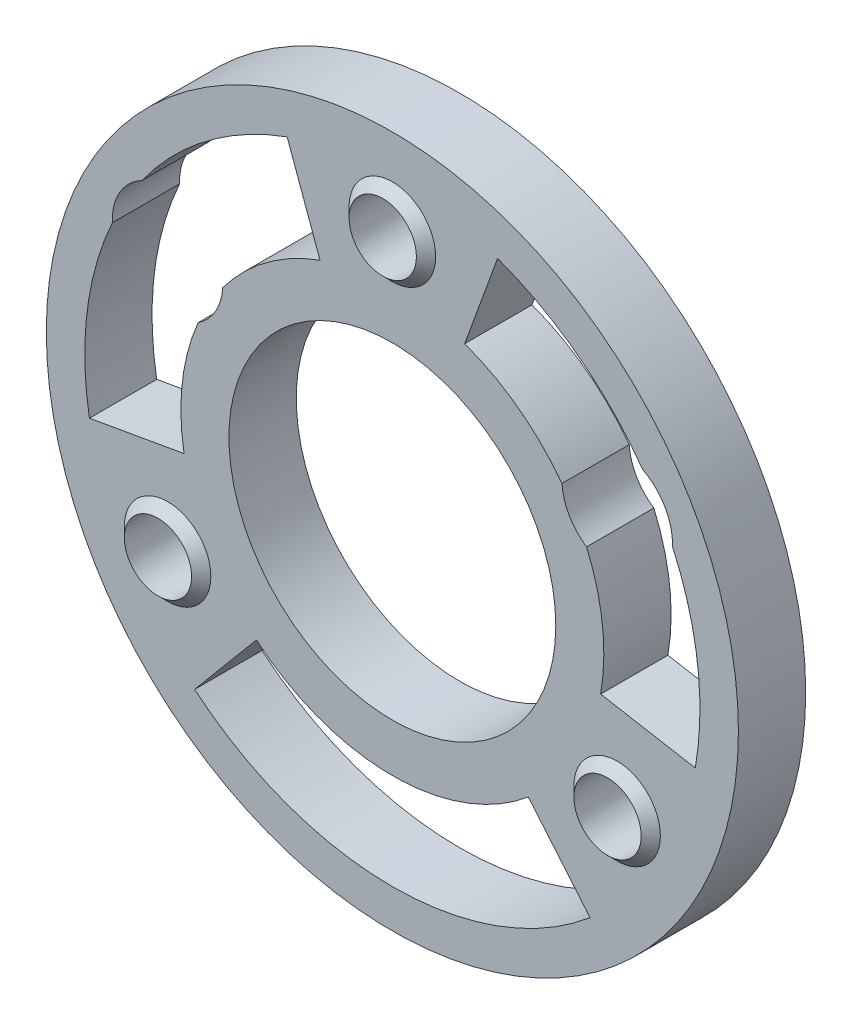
ISO-10303-21;
HEADER;
FILE_DESCRIPTION(('STEP AP214'),'2;1');
FILE_NAME('part.step','',(''),(''),'','','');
FILE_SCHEMA(('AUTOMOTIVE_DESIGN { 1 0 10303 214 1 1 1 1 }'));
ENDSEC;
DATA;
#1=APPLICATION_CONTEXT('core data for automotive mechanical design processes');
#2=APPLICATION_PROTOCOL_DEFINITION('international standard','automotive_design',2000,#1);
#3=PRODUCT_CONTEXT('',#1,'mechanical');
#4=PRODUCT('Part','Part','',(#3));
#5=PRODUCT_RELATED_PRODUCT_CATEGORY('part','',(#4));
#6=PRODUCT_DEFINITION_FORMATION('','',#4);
#7=PRODUCT_DEFINITION_CONTEXT('part definition',#1,'design');
#8=PRODUCT_DEFINITION('design','',#6,#7);
#9=PRODUCT_DEFINITION_SHAPE('','',#8);
#10=(LENGTH_UNIT() NAMED_UNIT(*) SI_UNIT(.MILLI.,.METRE.));
#11=(NAMED_UNIT(*) PLANE_ANGLE_UNIT() SI_UNIT($,.RADIAN.));
#12=(NAMED_UNIT(*) SI_UNIT($,.STERADIAN.) SOLID_ANGLE_UNIT());
#13=UNCERTAINTY_MEASURE_WITH_UNIT(LENGTH_MEASURE(1.E-05),#10,'distance_accuracy_value','');
#14=(GEOMETRIC_REPRESENTATION_CONTEXT(3) GLOBAL_UNCERTAINTY_ASSIGNED_CONTEXT((#13)) GLOBAL_UNIT_ASSIGNED_CONTEXT((#10,
#11,#12)) REPRESENTATION_CONTEXT('',''));
#15=CARTESIAN_POINT('',(0.,0.,0.));
#16=DIRECTION('',(0.,0.,1.));
#17=DIRECTION('',(1.,0.,0.));
#18=AXIS2_PLACEMENT_3D('',#15,#16,#17);
#19=CARTESIAN_POINT('',(0.,0.,3.5));
#20=DIRECTION('',(0.,0.,-1.));
#21=DIRECTION('',(-1.,0.,0.));
#22=AXIS2_PLACEMENT_3D('',#19,#20,#21);
#23=CYLINDRICAL_SURFACE('',#22,11.);
#24=DIRECTION('',(0.,0.,-1.));
#25=VECTOR('',#24,1.);
#26=CARTESIAN_POINT('',(-8.82194314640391,6.57064069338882,2.));
#27=LINE('',#26,#25);
#28=CARTESIAN_POINT('',(-8.82194314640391,6.57064069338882,3.5));
#29=VERTEX_POINT('',#28);
#30=CARTESIAN_POINT('',(-8.82194314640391,6.57064069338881,0.));
#31=VERTEX_POINT('',#30);
#32=EDGE_CURVE('E437',#29,#31,#27,.T.);
#33=ORIENTED_EDGE('',*,*,#32,.F.);
#34=CARTESIAN_POINT('',(0.,0.,3.5));
#35=DIRECTION('',(0.,0.,-1.));
#36=DIRECTION('',(-1.,0.,0.));
#37=AXIS2_PLACEMENT_3D('',#34,#35,#36);
#38=CIRCLE('',#37,11.);
#39=CARTESIAN_POINT('',(-3.76222157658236,10.336618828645,3.5));
#40=VERTEX_POINT('',#39);
#41=EDGE_CURVE('E249',#29,#40,#38,.T.);
#42=ORIENTED_EDGE('',*,*,#41,.T.);
#43=DIRECTION('',(0.,0.,-1.));
#44=VECTOR('',#43,1.);
#45=CARTESIAN_POINT('',(-3.76222157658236,10.336618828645,3.5));
#46=LINE('',#45,#44);
#47=CARTESIAN_POINT('',(-3.76222157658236,10.336618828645,0.));
#48=VERTEX_POINT('',#47);
#49=EDGE_CURVE('E288',#40,#48,#46,.T.);
#50=ORIENTED_EDGE('',*,*,#49,.T.);
#51=CARTESIAN_POINT('',(0.,0.,0.));
#52=DIRECTION('',(0.,0.,-1.));
#53=DIRECTION('',(-1.,0.,0.));
#54=AXIS2_PLACEMENT_3D('',#51,#52,#53);
#55=CIRCLE('',#54,11.);
#56=EDGE_CURVE('E243',#31,#48,#55,.T.);
#57=ORIENTED_EDGE('',*,*,#56,.F.);
#58=EDGE_LOOP('',(#33,#42,#50,#57));
#59=FACE_BOUND('',#58,.T.);
#60=ADVANCED_FACE('F47',(#59),#23,.T.);
#61=CARTESIAN_POINT('',(1.17961196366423E-13,0.,3.5));
#62=DIRECTION('',(0.,0.,-1.));
#63=DIRECTION('',(-1.,0.,0.));
#64=AXIS2_PLACEMENT_3D('',#61,#62,#63);
#65=CYLINDRICAL_SURFACE('',#64,16.0000000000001);
#66=DIRECTION('',(0.,0.,-1.));
#67=VECTOR('',#66,1.);
#68=CARTESIAN_POINT('',(-13.0198556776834,9.29964290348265,2.));
#69=LINE('',#68,#67);
#70=CARTESIAN_POINT('',(-13.0198556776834,9.29964290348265,0.));
#71=VERTEX_POINT('',#70);
#72=CARTESIAN_POINT('',(-13.0198556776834,9.29964290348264,3.5));
#73=VERTEX_POINT('',#72);
#74=EDGE_CURVE('E11',#71,#73,#69,.F.);
#75=ORIENTED_EDGE('',*,*,#74,.F.);
#76=CARTESIAN_POINT('',(1.17961196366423E-13,0.,0.));
#77=DIRECTION('',(0.,0.,1.));
#78=DIRECTION('',(-1.,0.,0.));
#79=AXIS2_PLACEMENT_3D('',#76,#77,#78);
#80=CIRCLE('',#79,16.0000000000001);
#81=CARTESIAN_POINT('',(-5.47232229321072,15.0350819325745,0.));
#82=VERTEX_POINT('',#81);
#83=EDGE_CURVE('E270',#82,#71,#80,.T.);
#84=ORIENTED_EDGE('',*,*,#83,.F.);
#85=DIRECTION('',(0.,0.,-1.));
#86=VECTOR('',#85,1.);
#87=CARTESIAN_POINT('',(-5.47232229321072,15.0350819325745,3.5));
#88=LINE('',#87,#86);
#89=CARTESIAN_POINT('',(-5.47232229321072,15.0350819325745,3.5));
#90=VERTEX_POINT('',#89);
#91=EDGE_CURVE('E285',#90,#82,#88,.T.);
#92=ORIENTED_EDGE('',*,*,#91,.F.);
#93=CARTESIAN_POINT('',(1.17961196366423E-13,0.,3.5));
#94=DIRECTION('',(0.,0.,1.));
#95=DIRECTION('',(-1.,0.,0.));
#96=AXIS2_PLACEMENT_3D('',#93,#94,#95);
#97=CIRCLE('',#96,16.0000000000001);
#98=EDGE_CURVE('E253',#90,#73,#97,.T.);
#99=ORIENTED_EDGE('',*,*,#98,.T.);
#100=EDGE_LOOP('',(#75,#84,#92,#99));
#101=FACE_BOUND('',#100,.T.);
#102=ADVANCED_FACE('F488',(#101),#65,.F.);
#103=CARTESIAN_POINT('',(0.,0.,3.5));
#104=DIRECTION('',(0.,0.,-1.));
#105=DIRECTION('',(-1.,0.,0.));
#106=AXIS2_PLACEMENT_3D('',#103,#104,#105);
#107=CYLINDRICAL_SURFACE('',#106,11.);
#108=DIRECTION('',(0.,0.,-1.));
#109=VECTOR('',#108,1.);
#110=CARTESIAN_POINT('',(10.1013133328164,4.3547065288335,2.));
#111=LINE('',#110,#109);
#112=CARTESIAN_POINT('',(10.1013133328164,4.3547065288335,3.5));
#113=VERTEX_POINT('',#112);
#114=CARTESIAN_POINT('',(10.1013133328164,4.3547065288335,0.));
#115=VERTEX_POINT('',#114);
#116=EDGE_CURVE('E446',#113,#115,#111,.T.);
#117=ORIENTED_EDGE('',*,*,#116,.F.);
#118=CARTESIAN_POINT('',(0.,0.,3.5));
#119=DIRECTION('',(0.,0.,-1.));
#120=DIRECTION('',(-1.,0.,0.));
#121=AXIS2_PLACEMENT_3D('',#118,#119,#120);
#122=CIRCLE('',#121,11.);
#123=CARTESIAN_POINT('',(10.8328852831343,-1.91012995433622,3.5));
#124=VERTEX_POINT('',#123);
#125=EDGE_CURVE('E228',#113,#124,#122,.T.);
#126=ORIENTED_EDGE('',*,*,#125,.T.);
#127=DIRECTION('',(0.,0.,-1.));
#128=VECTOR('',#127,1.);
#129=CARTESIAN_POINT('',(10.8328852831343,-1.91012995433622,3.5));
#130=LINE('',#129,#128);
#131=CARTESIAN_POINT('',(10.8328852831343,-1.91012995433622,0.));
#132=VERTEX_POINT('',#131);
#133=EDGE_CURVE('E239',#124,#132,#130,.T.);
#134=ORIENTED_EDGE('',*,*,#133,.T.);
#135=CARTESIAN_POINT('',(0.,0.,0.));
#136=DIRECTION('',(0.,0.,-1.));
#137=DIRECTION('',(-1.,0.,0.));
#138=AXIS2_PLACEMENT_3D('',#135,#136,#137);
#139=CIRCLE('',#138,11.);
#140=EDGE_CURVE('E362',#115,#132,#139,.T.);
#141=ORIENTED_EDGE('',*,*,#140,.F.);
#142=EDGE_LOOP('',(#117,#126,#134,#141));
#143=FACE_BOUND('',#142,.T.);
#144=ADVANCED_FACE('F461',(#143),#107,.T.);
#145=CARTESIAN_POINT('',(1.17961196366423E-13,0.,3.5));
#146=DIRECTION('',(0.,0.,-1.));
#147=DIRECTION('',(-1.,0.,0.));
#148=AXIS2_PLACEMENT_3D('',#145,#146,#147);
#149=CYLINDRICAL_SURFACE('',#148,15.9999999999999);
#150=DIRECTION('',(0.,0.,-1.));
#151=VECTOR('',#150,1.);
#152=CARTESIAN_POINT('',(14.5636548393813,6.62570431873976,2.));
#153=LINE('',#152,#151);
#154=CARTESIAN_POINT('',(14.5636548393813,6.62570431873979,0.));
#155=VERTEX_POINT('',#154);
#156=CARTESIAN_POINT('',(14.5636548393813,6.62570431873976,3.5));
#157=VERTEX_POINT('',#156);
#158=EDGE_CURVE('E195',#155,#157,#153,.F.);
#159=ORIENTED_EDGE('',*,*,#158,.F.);
#160=CARTESIAN_POINT('',(1.17961196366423E-13,0.,0.));
#161=DIRECTION('',(0.,0.,1.));
#162=DIRECTION('',(-1.,0.,0.));
#163=AXIS2_PLACEMENT_3D('',#160,#161,#162);
#164=CIRCLE('',#163,15.9999999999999);
#165=CARTESIAN_POINT('',(15.7569240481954,-2.77837084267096,0.));
#166=VERTEX_POINT('',#165);
#167=EDGE_CURVE('E208',#166,#155,#164,.T.);
#168=ORIENTED_EDGE('',*,*,#167,.F.);
#169=DIRECTION('',(0.,0.,-1.));
#170=VECTOR('',#169,1.);
#171=CARTESIAN_POINT('',(15.7569240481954,-2.77837084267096,3.5));
#172=LINE('',#171,#170);
#173=CARTESIAN_POINT('',(15.7569240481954,-2.77837084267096,3.5));
#174=VERTEX_POINT('',#173);
#175=EDGE_CURVE('E236',#174,#166,#172,.T.);
#176=ORIENTED_EDGE('',*,*,#175,.F.);
#177=CARTESIAN_POINT('',(1.17961196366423E-13,0.,3.5));
#178=DIRECTION('',(0.,0.,1.));
#179=DIRECTION('',(-1.,0.,0.));
#180=AXIS2_PLACEMENT_3D('',#177,#178,#179);
#181=CIRCLE('',#180,15.9999999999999);
#182=EDGE_CURVE('E340',#174,#157,#181,.T.);
#183=ORIENTED_EDGE('',*,*,#182,.T.);
#184=EDGE_LOOP('',(#159,#168,#176,#183));
#185=FACE_BOUND('',#184,.T.);
#186=ADVANCED_FACE('F470',(#185),#149,.F.);
#187=CARTESIAN_POINT('',(0.,0.,3.5));
#188=DIRECTION('',(0.,0.,1.));
#189=DIRECTION('',(1.,0.,0.));
#190=AXIS2_PLACEMENT_3D('',#187,#188,#189);
#191=PLANE('',#190);
#192=CARTESIAN_POINT('',(11.6913429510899,6.75000000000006,3.5));
#193=DIRECTION('',(0.,0.,1.));
#194=DIRECTION('',(1.,0.,0.));
#195=AXIS2_PLACEMENT_3D('',#192,#193,#194);
#196=CIRCLE('',#195,2.875);
#197=CARTESIAN_POINT('',(8.82194314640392,6.57064069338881,3.5));
#198=VERTEX_POINT('',#197);
#199=EDGE_CURVE('E449',#198,#113,#196,.T.);
#200=ORIENTED_EDGE('',*,*,#199,.F.);
#201=CARTESIAN_POINT('',(3.76222157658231,10.336618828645,3.5));
#202=VERTEX_POINT('',#201);
#203=EDGE_CURVE('E349',#202,#198,#122,.T.);
#204=ORIENTED_EDGE('',*,*,#203,.F.);
#205=DIRECTION('',(-0.342020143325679,-0.939692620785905,0.));
#206=VECTOR('',#205,1.);
#207=CARTESIAN_POINT('',(5.4723222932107,15.0350819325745,3.5));
#208=LINE('',#207,#206);
#209=CARTESIAN_POINT('',(5.4723222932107,15.0350819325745,3.5));
#210=VERTEX_POINT('',#209);
#211=EDGE_CURVE('E233',#210,#202,#208,.T.);
#212=ORIENTED_EDGE('',*,*,#211,.F.);
#213=CARTESIAN_POINT('',(13.0198556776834,9.29964290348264,3.5));
#214=VERTEX_POINT('',#213);
#215=EDGE_CURVE('E344',#214,#210,#181,.T.);
#216=ORIENTED_EDGE('',*,*,#215,.F.);
#217=EDGE_CURVE('E190',#157,#214,#196,.T.);
#218=ORIENTED_EDGE('',*,*,#217,.F.);
#219=ORIENTED_EDGE('',*,*,#182,.F.);
#220=DIRECTION('',(0.984807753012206,-0.173648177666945,0.));
#221=VECTOR('',#220,1.);
#222=CARTESIAN_POINT('',(15.7569240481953,-2.77837084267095,3.5));
#223=LINE('',#222,#221);
#224=EDGE_CURVE('E347',#124,#174,#223,.T.);
#225=ORIENTED_EDGE('',*,*,#224,.F.);
#226=ORIENTED_EDGE('',*,*,#125,.F.);
#227=EDGE_LOOP('',(#200,#204,#212,#216,#218,#219,#225,#226));
#228=FACE_BOUND('',#227,.T.);
#229=CARTESIAN_POINT('',(-11.6913429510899,6.75000000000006,3.5));
#230=DIRECTION('',(0.,0.,1.));
#231=DIRECTION('',(1.,0.,0.));
#232=AXIS2_PLACEMENT_3D('',#229,#230,#231);
#233=CIRCLE('',#232,2.875);
#234=CARTESIAN_POINT('',(-14.5636548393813,6.62570431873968,3.5));
#235=VERTEX_POINT('',#234);
#236=EDGE_CURVE('E71',#73,#235,#233,.T.);
#237=ORIENTED_EDGE('',*,*,#236,.F.);
#238=ORIENTED_EDGE('',*,*,#98,.F.);
#239=DIRECTION('',(-0.342020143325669,0.939692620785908,0.));
#240=VECTOR('',#239,1.);
#241=CARTESIAN_POINT('',(-5.47232229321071,15.0350819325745,3.5));
#242=LINE('',#241,#240);
#243=EDGE_CURVE('E248',#40,#90,#242,.T.);
#244=ORIENTED_EDGE('',*,*,#243,.F.);
#245=ORIENTED_EDGE('',*,*,#41,.F.);
#246=CARTESIAN_POINT('',(-10.1013133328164,4.35470652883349,3.5));
#247=VERTEX_POINT('',#246);
#248=EDGE_CURVE('E440',#247,#29,#233,.T.);
#249=ORIENTED_EDGE('',*,*,#248,.F.);
#250=CARTESIAN_POINT('',(-10.8328852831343,-1.91012995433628,3.5));
#251=VERTEX_POINT('',#250);
#252=EDGE_CURVE('E244',#251,#247,#38,.T.);
#253=ORIENTED_EDGE('',*,*,#252,.F.);
#254=DIRECTION('',(0.984807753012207,0.173648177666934,0.));
#255=VECTOR('',#254,1.);
#256=CARTESIAN_POINT('',(-15.7569240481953,-2.77837084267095,3.5));
#257=LINE('',#256,#255);
#258=CARTESIAN_POINT('',(-15.7569240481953,-2.77837084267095,3.5));
#259=VERTEX_POINT('',#258);
#260=EDGE_CURVE('E257',#259,#251,#257,.T.);
#261=ORIENTED_EDGE('',*,*,#260,.F.);
#262=EDGE_CURVE('E252',#235,#259,#97,.T.);
#263=ORIENTED_EDGE('',*,*,#262,.F.);
#264=EDGE_LOOP('',(#237,#238,#244,#245,#249,#253,#261,#263));
#265=FACE_BOUND('',#264,.T.);
#266=CARTESIAN_POINT('',(-11.6913429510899,-6.75000000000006,3.5));
#267=DIRECTION('',(0.,0.,1.));
#268=DIRECTION('',(1.,0.,0.));
#269=AXIS2_PLACEMENT_3D('',#266,#267,#268);
#270=CIRCLE('',#269,2.25);
#271=CARTESIAN_POINT('',(-9.44134295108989,-6.75000000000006,3.5));
#272=VERTEX_POINT('',#271);
#273=EDGE_CURVE('E425',#272,#272,#270,.T.);
#274=ORIENTED_EDGE('',*,*,#273,.F.);
#275=EDGE_LOOP('',(#274));
#276=FACE_BOUND('',#275,.T.);
#277=DIRECTION('',(-0.642787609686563,-0.766044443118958,0.));
#278=VECTOR('',#277,1.);
#279=CARTESIAN_POINT('',(-10.2846017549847,-12.2567110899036,3.5));
#280=LINE('',#279,#278);
#281=CARTESIAN_POINT('',(-7.07066370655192,-8.42648887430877,3.5));
#282=VERTEX_POINT('',#281);
#283=CARTESIAN_POINT('',(-10.2846017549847,-12.2567110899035,3.5));
#284=VERTEX_POINT('',#283);
#285=EDGE_CURVE('E409',#282,#284,#280,.T.);
#286=ORIENTED_EDGE('',*,*,#285,.F.);
#287=CARTESIAN_POINT('',(0.,0.,3.5));
#288=DIRECTION('',(0.,0.,-1.));
#289=DIRECTION('',(-1.,0.,0.));
#290=AXIS2_PLACEMENT_3D('',#287,#288,#289);
#291=CIRCLE('',#290,11.);
#292=CARTESIAN_POINT('',(7.07066370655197,-8.42648887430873,3.5));
#293=VERTEX_POINT('',#292);
#294=EDGE_CURVE('E390',#293,#282,#291,.T.);
#295=ORIENTED_EDGE('',*,*,#294,.F.);
#296=DIRECTION('',(-0.642787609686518,0.766044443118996,0.));
#297=VECTOR('',#296,1.);
#298=CARTESIAN_POINT('',(10.2846017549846,-12.2567110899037,3.5));
#299=LINE('',#298,#297);
#300=CARTESIAN_POINT('',(10.2846017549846,-12.2567110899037,3.5));
#301=VERTEX_POINT('',#300);
#302=EDGE_CURVE('E385',#301,#293,#299,.T.);
#303=ORIENTED_EDGE('',*,*,#302,.F.);
#304=CARTESIAN_POINT('',(1.17961196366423E-13,0.,3.5));
#305=DIRECTION('',(0.,0.,1.));
#306=DIRECTION('',(-1.,0.,0.));
#307=AXIS2_PLACEMENT_3D('',#304,#305,#306);
#308=CIRCLE('',#307,16.);
#309=EDGE_CURVE('E405',#284,#301,#308,.T.);
#310=ORIENTED_EDGE('',*,*,#309,.F.);
#311=EDGE_LOOP('',(#286,#295,#303,#310));
#312=FACE_BOUND('',#311,.T.);
#313=CARTESIAN_POINT('',(0.,0.,3.5));
#314=DIRECTION('',(0.,0.,1.));
#315=DIRECTION('',(1.,0.,0.));
#316=AXIS2_PLACEMENT_3D('',#313,#314,#315);
#317=CIRCLE('',#316,18.);
#318=CARTESIAN_POINT('',(18.,0.,3.5));
#319=VERTEX_POINT('',#318);
#320=EDGE_CURVE('E196',#319,#319,#317,.T.);
#321=ORIENTED_EDGE('',*,*,#320,.T.);
#322=EDGE_LOOP('',(#321));
#323=FACE_BOUND('',#322,.T.);
#324=CARTESIAN_POINT('',(0.,0.,3.5));
#325=DIRECTION('',(0.,0.,1.));
#326=DIRECTION('',(1.,0.,0.));
#327=AXIS2_PLACEMENT_3D('',#324,#325,#326);
#328=CIRCLE('',#327,8.5);
#329=CARTESIAN_POINT('',(8.5,0.,3.5));
#330=VERTEX_POINT('',#329);
#331=EDGE_CURVE('E305',#330,#330,#328,.T.);
#332=ORIENTED_EDGE('',*,*,#331,.F.);
#333=EDGE_LOOP('',(#332));
#334=FACE_BOUND('',#333,.T.);
#335=CARTESIAN_POINT('',(0.,13.5,3.5));
#336=DIRECTION('',(0.,0.,1.));
#337=DIRECTION('',(1.,0.,0.));
#338=AXIS2_PLACEMENT_3D('',#335,#336,#337);
#339=CIRCLE('',#338,2.25);
#340=CARTESIAN_POINT('',(2.25,13.5,3.5));
#341=VERTEX_POINT('',#340);
#342=EDGE_CURVE('E402',#341,#341,#339,.T.);
#343=ORIENTED_EDGE('',*,*,#342,.F.);
#344=EDGE_LOOP('',(#343));
#345=FACE_BOUND('',#344,.T.);
#346=CARTESIAN_POINT('',(11.6913429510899,-6.75000000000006,3.5));
#347=DIRECTION('',(0.,0.,1.));
#348=DIRECTION('',(1.,0.,0.));
#349=AXIS2_PLACEMENT_3D('',#346,#347,#348);
#350=CIRCLE('',#349,2.25);
#351=CARTESIAN_POINT('',(13.9413429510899,-6.75000000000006,3.5));
#352=VERTEX_POINT('',#351);
#353=EDGE_CURVE('E433',#352,#352,#350,.T.);
#354=ORIENTED_EDGE('',*,*,#353,.F.);
#355=EDGE_LOOP('',(#354));
#356=FACE_BOUND('',#355,.T.);
#357=ADVANCED_FACE('F463',(#228,#265,#276,#312,#323,#334,#345,#356),#191,.T.);
#358=CARTESIAN_POINT('',(0.,0.,0.));
#359=DIRECTION('',(0.,0.,1.));
#360=DIRECTION('',(1.,0.,0.));
#361=AXIS2_PLACEMENT_3D('',#358,#359,#360);
#362=PLANE('',#361);
#363=CARTESIAN_POINT('',(3.76222157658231,10.336618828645,0.));
#364=VERTEX_POINT('',#363);
#365=CARTESIAN_POINT('',(8.82194314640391,6.57064069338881,0.));
#366=VERTEX_POINT('',#365);
#367=EDGE_CURVE('E222',#364,#366,#139,.T.);
#368=ORIENTED_EDGE('',*,*,#367,.T.);
#369=CARTESIAN_POINT('',(11.6913429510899,6.75000000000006,0.));
#370=DIRECTION('',(0.,0.,-1.));
#371=DIRECTION('',(-1.,0.,0.));
#372=AXIS2_PLACEMENT_3D('',#369,#370,#371);
#373=CIRCLE('',#372,2.875);
#374=EDGE_CURVE('E210',#115,#366,#373,.T.);
#375=ORIENTED_EDGE('',*,*,#374,.F.);
#376=ORIENTED_EDGE('',*,*,#140,.T.);
#377=DIRECTION('',(0.984807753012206,-0.173648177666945,0.));
#378=VECTOR('',#377,1.);
#379=CARTESIAN_POINT('',(15.7569240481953,-2.77837084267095,0.));
#380=LINE('',#379,#378);
#381=EDGE_CURVE('E217',#132,#166,#380,.T.);
#382=ORIENTED_EDGE('',*,*,#381,.T.);
#383=ORIENTED_EDGE('',*,*,#167,.T.);
#384=CARTESIAN_POINT('',(13.0198556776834,9.29964290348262,0.));
#385=VERTEX_POINT('',#384);
#386=EDGE_CURVE('E187',#385,#155,#373,.T.);
#387=ORIENTED_EDGE('',*,*,#386,.F.);
#388=CARTESIAN_POINT('',(5.4723222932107,15.0350819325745,0.));
#389=VERTEX_POINT('',#388);
#390=EDGE_CURVE('E204',#385,#389,#164,.T.);
#391=ORIENTED_EDGE('',*,*,#390,.T.);
#392=DIRECTION('',(-0.342020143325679,-0.939692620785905,0.));
#393=VECTOR('',#392,1.);
#394=CARTESIAN_POINT('',(5.4723222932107,15.0350819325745,0.));
#395=LINE('',#394,#393);
#396=EDGE_CURVE('E221',#389,#364,#395,.T.);
#397=ORIENTED_EDGE('',*,*,#396,.T.);
#398=EDGE_LOOP('',(#368,#375,#376,#382,#383,#387,#391,#397));
#399=FACE_BOUND('',#398,.T.);
#400=CARTESIAN_POINT('',(11.6913429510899,-6.75000000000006,0.));
#401=DIRECTION('',(0.,0.,1.));
#402=DIRECTION('',(1.,0.,0.));
#403=AXIS2_PLACEMENT_3D('',#400,#401,#402);
#404=CIRCLE('',#403,1.75);
#405=CARTESIAN_POINT('',(13.4413429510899,-6.75000000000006,0.));
#406=VERTEX_POINT('',#405);
#407=EDGE_CURVE('E292',#406,#406,#404,.T.);
#408=ORIENTED_EDGE('',*,*,#407,.T.);
#409=EDGE_LOOP('',(#408));
#410=FACE_BOUND('',#409,.T.);
#411=CARTESIAN_POINT('',(-11.6913429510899,-6.75000000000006,0.));
#412=DIRECTION('',(0.,0.,1.));
#413=DIRECTION('',(1.,0.,0.));
#414=AXIS2_PLACEMENT_3D('',#411,#412,#413);
#415=CIRCLE('',#414,1.75);
#416=CARTESIAN_POINT('',(-9.94134295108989,-6.75000000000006,0.));
#417=VERTEX_POINT('',#416);
#418=EDGE_CURVE('E296',#417,#417,#415,.T.);
#419=ORIENTED_EDGE('',*,*,#418,.T.);
#420=EDGE_LOOP('',(#419));
#421=FACE_BOUND('',#420,.T.);
#422=CARTESIAN_POINT('',(0.,13.5,0.));
#423=DIRECTION('',(0.,0.,1.));
#424=DIRECTION('',(1.,0.,0.));
#425=AXIS2_PLACEMENT_3D('',#422,#423,#424);
#426=CIRCLE('',#425,1.75);
#427=CARTESIAN_POINT('',(1.75,13.5,0.));
#428=VERTEX_POINT('',#427);
#429=EDGE_CURVE('E300',#428,#428,#426,.T.);
#430=ORIENTED_EDGE('',*,*,#429,.T.);
#431=EDGE_LOOP('',(#430));
#432=FACE_BOUND('',#431,.T.);
#433=CARTESIAN_POINT('',(0.,0.,0.));
#434=DIRECTION('',(0.,0.,1.));
#435=DIRECTION('',(1.,0.,0.));
#436=AXIS2_PLACEMENT_3D('',#433,#434,#435);
#437=CIRCLE('',#436,8.5);
#438=CARTESIAN_POINT('',(8.5,0.,0.));
#439=VERTEX_POINT('',#438);
#440=EDGE_CURVE('E304',#439,#439,#437,.T.);
#441=ORIENTED_EDGE('',*,*,#440,.T.);
#442=EDGE_LOOP('',(#441));
#443=FACE_BOUND('',#442,.T.);
#444=CARTESIAN_POINT('',(0.,0.,0.));
#445=DIRECTION('',(0.,0.,1.));
#446=DIRECTION('',(1.,0.,0.));
#447=AXIS2_PLACEMENT_3D('',#444,#445,#446);
#448=CIRCLE('',#447,18.);
#449=CARTESIAN_POINT('',(18.,0.,0.));
#450=VERTEX_POINT('',#449);
#451=EDGE_CURVE('E309',#450,#450,#448,.T.);
#452=ORIENTED_EDGE('',*,*,#451,.F.);
#453=EDGE_LOOP('',(#452));
#454=FACE_BOUND('',#453,.T.);
#455=ORIENTED_EDGE('',*,*,#83,.T.);
#456=CARTESIAN_POINT('',(-11.6913429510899,6.75000000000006,0.));
#457=DIRECTION('',(0.,0.,-1.));
#458=DIRECTION('',(-1.,0.,0.));
#459=AXIS2_PLACEMENT_3D('',#456,#457,#458);
#460=CIRCLE('',#459,2.875);
#461=CARTESIAN_POINT('',(-14.5636548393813,6.62570431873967,0.));
#462=VERTEX_POINT('',#461);
#463=EDGE_CURVE('E323',#462,#71,#460,.T.);
#464=ORIENTED_EDGE('',*,*,#463,.F.);
#465=CARTESIAN_POINT('',(-15.7569240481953,-2.77837084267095,0.));
#466=VERTEX_POINT('',#465);
#467=EDGE_CURVE('E269',#462,#466,#80,.T.);
#468=ORIENTED_EDGE('',*,*,#467,.T.);
#469=DIRECTION('',(0.984807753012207,0.173648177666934,0.));
#470=VECTOR('',#469,1.);
#471=CARTESIAN_POINT('',(-15.7569240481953,-2.77837084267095,0.));
#472=LINE('',#471,#470);
#473=CARTESIAN_POINT('',(-10.8328852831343,-1.91012995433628,0.));
#474=VERTEX_POINT('',#473);
#475=EDGE_CURVE('E274',#466,#474,#472,.T.);
#476=ORIENTED_EDGE('',*,*,#475,.T.);
#477=CARTESIAN_POINT('',(-10.1013133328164,4.3547065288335,0.));
#478=VERTEX_POINT('',#477);
#479=EDGE_CURVE('E261',#474,#478,#55,.T.);
#480=ORIENTED_EDGE('',*,*,#479,.T.);
#481=EDGE_CURVE('E64',#31,#478,#460,.T.);
#482=ORIENTED_EDGE('',*,*,#481,.F.);
#483=ORIENTED_EDGE('',*,*,#56,.T.);
#484=DIRECTION('',(-0.342020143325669,0.939692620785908,0.));
#485=VECTOR('',#484,1.);
#486=CARTESIAN_POINT('',(-5.47232229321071,15.0350819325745,0.));
#487=LINE('',#486,#485);
#488=EDGE_CURVE('E265',#48,#82,#487,.T.);
#489=ORIENTED_EDGE('',*,*,#488,.T.);
#490=EDGE_LOOP('',(#455,#464,#468,#476,#480,#482,#483,#489));
#491=FACE_BOUND('',#490,.T.);
#492=CARTESIAN_POINT('',(0.,0.,0.));
#493=DIRECTION('',(0.,0.,-1.));
#494=DIRECTION('',(-1.,0.,0.));
#495=AXIS2_PLACEMENT_3D('',#492,#493,#494);
#496=CIRCLE('',#495,11.);
#497=CARTESIAN_POINT('',(7.07066370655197,-8.42648887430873,0.));
#498=VERTEX_POINT('',#497);
#499=CARTESIAN_POINT('',(-7.07066370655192,-8.42648887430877,0.));
#500=VERTEX_POINT('',#499);
#501=EDGE_CURVE('E399',#498,#500,#496,.T.);
#502=ORIENTED_EDGE('',*,*,#501,.T.);
#503=DIRECTION('',(-0.642787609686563,-0.766044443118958,0.));
#504=VECTOR('',#503,1.);
#505=CARTESIAN_POINT('',(-10.2846017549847,-12.2567110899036,0.));
#506=LINE('',#505,#504);
#507=CARTESIAN_POINT('',(-10.2846017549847,-12.2567110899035,0.));
#508=VERTEX_POINT('',#507);
#509=EDGE_CURVE('E395',#500,#508,#506,.T.);
#510=ORIENTED_EDGE('',*,*,#509,.T.);
#511=CARTESIAN_POINT('',(1.17961196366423E-13,0.,0.));
#512=DIRECTION('',(0.,0.,1.));
#513=DIRECTION('',(-1.,0.,0.));
#514=AXIS2_PLACEMENT_3D('',#511,#512,#513);
#515=CIRCLE('',#514,16.);
#516=CARTESIAN_POINT('',(10.2846017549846,-12.2567110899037,0.));
#517=VERTEX_POINT('',#516);
#518=EDGE_CURVE('E391',#508,#517,#515,.T.);
#519=ORIENTED_EDGE('',*,*,#518,.T.);
#520=DIRECTION('',(-0.642787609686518,0.766044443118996,0.));
#521=VECTOR('',#520,1.);
#522=CARTESIAN_POINT('',(10.2846017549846,-12.2567110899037,0.));
#523=LINE('',#522,#521);
#524=EDGE_CURVE('E386',#517,#498,#523,.T.);
#525=ORIENTED_EDGE('',*,*,#524,.T.);
#526=EDGE_LOOP('',(#502,#510,#519,#525));
#527=FACE_BOUND('',#526,.T.);
#528=ADVANCED_FACE('F201',(#399,#410,#421,#432,#443,#454,#491,#527),#362,.F.);
#529=CARTESIAN_POINT('',(0.,0.,3.5));
#530=DIRECTION('',(0.,0.,-1.));
#531=DIRECTION('',(-1.,0.,0.));
#532=AXIS2_PLACEMENT_3D('',#529,#530,#531);
#533=CYLINDRICAL_SURFACE('',#532,18.);
#534=ORIENTED_EDGE('',*,*,#320,.F.);
#535=EDGE_LOOP('',(#534));
#536=FACE_BOUND('',#535,.T.);
#537=ORIENTED_EDGE('',*,*,#451,.T.);
#538=EDGE_LOOP('',(#537));
#539=FACE_BOUND('',#538,.T.);
#540=ADVANCED_FACE('F567',(#536,#539),#533,.T.);
#541=CARTESIAN_POINT('',(0.,0.,3.5));
#542=DIRECTION('',(0.,0.,-1.));
#543=DIRECTION('',(-1.,0.,0.));
#544=AXIS2_PLACEMENT_3D('',#541,#542,#543);
#545=CYLINDRICAL_SURFACE('',#544,8.5);
#546=ORIENTED_EDGE('',*,*,#331,.T.);
#547=EDGE_LOOP('',(#546));
#548=FACE_BOUND('',#547,.T.);
#549=ORIENTED_EDGE('',*,*,#440,.F.);
#550=EDGE_LOOP('',(#549));
#551=FACE_BOUND('',#550,.T.);
#552=ADVANCED_FACE('F570',(#548,#551),#545,.F.);
#553=CARTESIAN_POINT('',(0.,13.5,3.5));
#554=DIRECTION('',(0.,0.,-1.));
#555=DIRECTION('',(-1.,0.,0.));
#556=AXIS2_PLACEMENT_3D('',#553,#554,#555);
#557=CYLINDRICAL_SURFACE('',#556,1.75);
#558=ORIENTED_EDGE('',*,*,#429,.F.);
#559=EDGE_LOOP('',(#558));
#560=FACE_BOUND('',#559,.T.);
#561=CARTESIAN_POINT('',(0.,13.5,4.));
#562=DIRECTION('',(0.,0.,1.));
#563=DIRECTION('',(1.,0.,0.));
#564=AXIS2_PLACEMENT_3D('',#561,#562,#563);
#565=CIRCLE('',#564,1.75);
#566=CARTESIAN_POINT('',(1.75,13.5,4.));
#567=VERTEX_POINT('',#566);
#568=EDGE_CURVE('E417',#567,#567,#565,.T.);
#569=ORIENTED_EDGE('',*,*,#568,.T.);
#570=EDGE_LOOP('',(#569));
#571=FACE_BOUND('',#570,.T.);
#572=ADVANCED_FACE('F592',(#560,#571),#557,.F.);
#573=CARTESIAN_POINT('',(-11.6913429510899,-6.75000000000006,3.5));
#574=DIRECTION('',(0.,0.,-1.));
#575=DIRECTION('',(-1.,0.,0.));
#576=AXIS2_PLACEMENT_3D('',#573,#574,#575);
#577=CYLINDRICAL_SURFACE('',#576,1.75);
#578=ORIENTED_EDGE('',*,*,#418,.F.);
#579=EDGE_LOOP('',(#578));
#580=FACE_BOUND('',#579,.T.);
#581=CARTESIAN_POINT('',(-11.6913429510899,-6.75000000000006,4.));
#582=DIRECTION('',(0.,0.,1.));
#583=DIRECTION('',(1.,0.,0.));
#584=AXIS2_PLACEMENT_3D('',#581,#582,#583);
#585=CIRCLE('',#584,1.75);
#586=CARTESIAN_POINT('',(-9.94134295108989,-6.75000000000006,4.));
#587=VERTEX_POINT('',#586);
#588=EDGE_CURVE('E421',#587,#587,#585,.T.);
#589=ORIENTED_EDGE('',*,*,#588,.T.);
#590=EDGE_LOOP('',(#589));
#591=FACE_BOUND('',#590,.T.);
#592=ADVANCED_FACE('F510',(#580,#591),#577,.F.);
#593=CARTESIAN_POINT('',(11.6913429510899,-6.75000000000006,3.5));
#594=DIRECTION('',(0.,0.,-1.));
#595=DIRECTION('',(-1.,0.,0.));
#596=AXIS2_PLACEMENT_3D('',#593,#594,#595);
#597=CYLINDRICAL_SURFACE('',#596,1.75);
#598=ORIENTED_EDGE('',*,*,#407,.F.);
#599=EDGE_LOOP('',(#598));
#600=FACE_BOUND('',#599,.T.);
#601=CARTESIAN_POINT('',(11.6913429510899,-6.75000000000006,4.));
#602=DIRECTION('',(0.,0.,1.));
#603=DIRECTION('',(1.,0.,0.));
#604=AXIS2_PLACEMENT_3D('',#601,#602,#603);
#605=CIRCLE('',#604,1.75);
#606=CARTESIAN_POINT('',(13.4413429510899,-6.75000000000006,4.));
#607=VERTEX_POINT('',#606);
#608=EDGE_CURVE('E429',#607,#607,#605,.T.);
#609=ORIENTED_EDGE('',*,*,#608,.T.);
#610=EDGE_LOOP('',(#609));
#611=FACE_BOUND('',#610,.T.);
#612=ADVANCED_FACE('F503',(#600,#611),#597,.F.);
#613=DIRECTION('',(0.,0.,-1.));
#614=VECTOR('',#613,1.);
#615=CARTESIAN_POINT('',(-10.1013133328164,4.3547065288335,2.));
#616=LINE('',#615,#614);
#617=EDGE_CURVE('E441',#478,#247,#616,.F.);
#618=ORIENTED_EDGE('',*,*,#617,.F.);
#619=ORIENTED_EDGE('',*,*,#479,.F.);
#620=DIRECTION('',(0.,0.,-1.));
#621=VECTOR('',#620,1.);
#622=CARTESIAN_POINT('',(-10.8328852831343,-1.91012995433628,3.5));
#623=LINE('',#622,#621);
#624=EDGE_CURVE('E260',#251,#474,#623,.T.);
#625=ORIENTED_EDGE('',*,*,#624,.F.);
#626=ORIENTED_EDGE('',*,*,#252,.T.);
#627=EDGE_LOOP('',(#618,#619,#625,#626));
#628=FACE_BOUND('',#627,.T.);
#629=ADVANCED_FACE('F492',(#628),#23,.T.);
#630=CARTESIAN_POINT('',(-5.47232229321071,15.0350819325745,3.5));
#631=DIRECTION('',(-0.939692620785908,-0.342020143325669,0.));
#632=DIRECTION('',(0.342020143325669,-0.939692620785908,0.));
#633=AXIS2_PLACEMENT_3D('',#630,#631,#632);
#634=PLANE('',#633);
#635=ORIENTED_EDGE('',*,*,#488,.F.);
#636=ORIENTED_EDGE('',*,*,#49,.F.);
#637=ORIENTED_EDGE('',*,*,#243,.T.);
#638=ORIENTED_EDGE('',*,*,#91,.T.);
#639=EDGE_LOOP('',(#635,#636,#637,#638));
#640=FACE_BOUND('',#639,.T.);
#641=ADVANCED_FACE('F502',(#640),#634,.T.);
#642=DIRECTION('',(0.,0.,-1.));
#643=VECTOR('',#642,1.);
#644=CARTESIAN_POINT('',(-14.5636548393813,6.62570431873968,2.));
#645=LINE('',#644,#643);
#646=EDGE_CURVE('E57',#235,#462,#645,.T.);
#647=ORIENTED_EDGE('',*,*,#646,.F.);
#648=ORIENTED_EDGE('',*,*,#262,.T.);
#649=DIRECTION('',(0.,0.,-1.));
#650=VECTOR('',#649,1.);
#651=CARTESIAN_POINT('',(-15.7569240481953,-2.77837084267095,3.5));
#652=LINE('',#651,#650);
#653=EDGE_CURVE('E281',#259,#466,#652,.T.);
#654=ORIENTED_EDGE('',*,*,#653,.T.);
#655=ORIENTED_EDGE('',*,*,#467,.F.);
#656=EDGE_LOOP('',(#647,#648,#654,#655));
#657=FACE_BOUND('',#656,.T.);
#658=ADVANCED_FACE('F333',(#657),#65,.F.);
#659=CARTESIAN_POINT('',(-15.7569240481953,-2.77837084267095,3.5));
#660=DIRECTION('',(-0.173648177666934,0.984807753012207,0.));
#661=DIRECTION('',(-0.984807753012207,-0.173648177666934,0.));
#662=AXIS2_PLACEMENT_3D('',#659,#660,#661);
#663=PLANE('',#662);
#664=ORIENTED_EDGE('',*,*,#475,.F.);
#665=ORIENTED_EDGE('',*,*,#653,.F.);
#666=ORIENTED_EDGE('',*,*,#260,.T.);
#667=ORIENTED_EDGE('',*,*,#624,.T.);
#668=EDGE_LOOP('',(#664,#665,#666,#667));
#669=FACE_BOUND('',#668,.T.);
#670=ADVANCED_FACE('F478',(#669),#663,.T.);
#671=DIRECTION('',(0.,0.,-1.));
#672=VECTOR('',#671,1.);
#673=CARTESIAN_POINT('',(8.82194314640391,6.57064069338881,2.));
#674=LINE('',#673,#672);
#675=EDGE_CURVE('E450',#366,#198,#674,.F.);
#676=ORIENTED_EDGE('',*,*,#675,.F.);
#677=ORIENTED_EDGE('',*,*,#367,.F.);
#678=DIRECTION('',(0.,0.,-1.));
#679=VECTOR('',#678,1.);
#680=CARTESIAN_POINT('',(3.76222157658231,10.336618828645,3.5));
#681=LINE('',#680,#679);
#682=EDGE_CURVE('E229',#202,#364,#681,.T.);
#683=ORIENTED_EDGE('',*,*,#682,.F.);
#684=ORIENTED_EDGE('',*,*,#203,.T.);
#685=EDGE_LOOP('',(#676,#677,#683,#684));
#686=FACE_BOUND('',#685,.T.);
#687=ADVANCED_FACE('F476',(#686),#107,.T.);
#688=CARTESIAN_POINT('',(15.7569240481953,-2.77837084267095,3.5));
#689=DIRECTION('',(0.173648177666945,0.984807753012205,0.));
#690=DIRECTION('',(-0.984807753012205,0.173648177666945,0.));
#691=AXIS2_PLACEMENT_3D('',#688,#689,#690);
#692=PLANE('',#691);
#693=ORIENTED_EDGE('',*,*,#381,.F.);
#694=ORIENTED_EDGE('',*,*,#133,.F.);
#695=ORIENTED_EDGE('',*,*,#224,.T.);
#696=ORIENTED_EDGE('',*,*,#175,.T.);
#697=EDGE_LOOP('',(#693,#694,#695,#696));
#698=FACE_BOUND('',#697,.T.);
#699=ADVANCED_FACE('F468',(#698),#692,.T.);
#700=DIRECTION('',(0.,0.,-1.));
#701=VECTOR('',#700,1.);
#702=CARTESIAN_POINT('',(13.0198556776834,9.29964290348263,2.));
#703=LINE('',#702,#701);
#704=EDGE_CURVE('E184',#214,#385,#703,.T.);
#705=ORIENTED_EDGE('',*,*,#704,.F.);
#706=ORIENTED_EDGE('',*,*,#215,.T.);
#707=DIRECTION('',(0.,0.,-1.));
#708=VECTOR('',#707,1.);
#709=CARTESIAN_POINT('',(5.4723222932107,15.0350819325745,3.5));
#710=LINE('',#709,#708);
#711=EDGE_CURVE('E214',#210,#389,#710,.T.);
#712=ORIENTED_EDGE('',*,*,#711,.T.);
#713=ORIENTED_EDGE('',*,*,#390,.F.);
#714=EDGE_LOOP('',(#705,#706,#712,#713));
#715=FACE_BOUND('',#714,.T.);
#716=ADVANCED_FACE('F212',(#715),#149,.F.);
#717=CARTESIAN_POINT('',(5.4723222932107,15.0350819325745,3.5));
#718=DIRECTION('',(0.939692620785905,-0.342020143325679,0.));
#719=DIRECTION('',(0.342020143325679,0.939692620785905,0.));
#720=AXIS2_PLACEMENT_3D('',#717,#718,#719);
#721=PLANE('',#720);
#722=ORIENTED_EDGE('',*,*,#396,.F.);
#723=ORIENTED_EDGE('',*,*,#711,.F.);
#724=ORIENTED_EDGE('',*,*,#211,.T.);
#725=ORIENTED_EDGE('',*,*,#682,.T.);
#726=EDGE_LOOP('',(#722,#723,#724,#725));
#727=FACE_BOUND('',#726,.T.);
#728=ADVANCED_FACE('F473',(#727),#721,.T.);
#729=CARTESIAN_POINT('',(0.,0.,3.5));
#730=DIRECTION('',(0.,0.,-1.));
#731=DIRECTION('',(-1.,0.,0.));
#732=AXIS2_PLACEMENT_3D('',#729,#730,#731);
#733=CYLINDRICAL_SURFACE('',#732,11.);
#734=ORIENTED_EDGE('',*,*,#501,.F.);
#735=DIRECTION('',(0.,0.,-1.));
#736=VECTOR('',#735,1.);
#737=CARTESIAN_POINT('',(7.07066370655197,-8.42648887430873,3.5));
#738=LINE('',#737,#736);
#739=EDGE_CURVE('E379',#293,#498,#738,.T.);
#740=ORIENTED_EDGE('',*,*,#739,.F.);
#741=ORIENTED_EDGE('',*,*,#294,.T.);
#742=DIRECTION('',(0.,0.,-1.));
#743=VECTOR('',#742,1.);
#744=CARTESIAN_POINT('',(-7.07066370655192,-8.42648887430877,3.5));
#745=LINE('',#744,#743);
#746=EDGE_CURVE('E359',#282,#500,#745,.T.);
#747=ORIENTED_EDGE('',*,*,#746,.T.);
#748=EDGE_LOOP('',(#734,#740,#741,#747));
#749=FACE_BOUND('',#748,.T.);
#750=ADVANCED_FACE('F551',(#749),#733,.T.);
#751=CARTESIAN_POINT('',(-10.2846017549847,-12.2567110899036,3.5));
#752=DIRECTION('',(0.766044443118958,-0.642787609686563,0.));
#753=DIRECTION('',(0.642787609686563,0.766044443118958,0.));
#754=AXIS2_PLACEMENT_3D('',#751,#752,#753);
#755=PLANE('',#754);
#756=ORIENTED_EDGE('',*,*,#509,.F.);
#757=ORIENTED_EDGE('',*,*,#746,.F.);
#758=ORIENTED_EDGE('',*,*,#285,.T.);
#759=DIRECTION('',(0.,0.,-1.));
#760=VECTOR('',#759,1.);
#761=CARTESIAN_POINT('',(-10.2846017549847,-12.2567110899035,3.5));
#762=LINE('',#761,#760);
#763=EDGE_CURVE('E369',#284,#508,#762,.T.);
#764=ORIENTED_EDGE('',*,*,#763,.T.);
#765=EDGE_LOOP('',(#756,#757,#758,#764));
#766=FACE_BOUND('',#765,.T.);
#767=ADVANCED_FACE('F547',(#766),#755,.T.);
#768=CARTESIAN_POINT('',(1.17961196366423E-13,0.,3.5));
#769=DIRECTION('',(0.,0.,-1.));
#770=DIRECTION('',(-1.,0.,0.));
#771=AXIS2_PLACEMENT_3D('',#768,#769,#770);
#772=CYLINDRICAL_SURFACE('',#771,16.);
#773=ORIENTED_EDGE('',*,*,#518,.F.);
#774=ORIENTED_EDGE('',*,*,#763,.F.);
#775=ORIENTED_EDGE('',*,*,#309,.T.);
#776=DIRECTION('',(0.,0.,-1.));
#777=VECTOR('',#776,1.);
#778=CARTESIAN_POINT('',(10.2846017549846,-12.2567110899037,3.5));
#779=LINE('',#778,#777);
#780=EDGE_CURVE('E374',#301,#517,#779,.T.);
#781=ORIENTED_EDGE('',*,*,#780,.T.);
#782=EDGE_LOOP('',(#773,#774,#775,#781));
#783=FACE_BOUND('',#782,.T.);
#784=ADVANCED_FACE('F543',(#783),#772,.F.);
#785=CARTESIAN_POINT('',(10.2846017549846,-12.2567110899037,3.5));
#786=DIRECTION('',(-0.766044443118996,-0.642787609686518,0.));
#787=DIRECTION('',(0.642787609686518,-0.766044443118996,0.));
#788=AXIS2_PLACEMENT_3D('',#785,#786,#787);
#789=PLANE('',#788);
#790=ORIENTED_EDGE('',*,*,#524,.F.);
#791=ORIENTED_EDGE('',*,*,#780,.F.);
#792=ORIENTED_EDGE('',*,*,#302,.T.);
#793=ORIENTED_EDGE('',*,*,#739,.T.);
#794=EDGE_LOOP('',(#790,#791,#792,#793));
#795=FACE_BOUND('',#794,.T.);
#796=ADVANCED_FACE('F540',(#795),#789,.T.);
#797=CARTESIAN_POINT('',(11.6913429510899,6.75000000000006,4.));
#798=DIRECTION('',(0.,0.,-1.));
#799=DIRECTION('',(-1.,0.,0.));
#800=AXIS2_PLACEMENT_3D('',#797,#798,#799);
#801=CYLINDRICAL_SURFACE('',#800,2.875);
#802=ORIENTED_EDGE('',*,*,#158,.T.);
#803=ORIENTED_EDGE('',*,*,#217,.T.);
#804=ORIENTED_EDGE('',*,*,#704,.T.);
#805=ORIENTED_EDGE('',*,*,#386,.T.);
#806=EDGE_LOOP('',(#802,#803,#804,#805));
#807=FACE_BOUND('',#806,.T.);
#808=ADVANCED_FACE('F186',(#807),#801,.F.);
#809=ORIENTED_EDGE('',*,*,#116,.T.);
#810=ORIENTED_EDGE('',*,*,#374,.T.);
#811=ORIENTED_EDGE('',*,*,#675,.T.);
#812=ORIENTED_EDGE('',*,*,#199,.T.);
#813=EDGE_LOOP('',(#809,#810,#811,#812));
#814=FACE_BOUND('',#813,.T.);
#815=ADVANCED_FACE('F457',(#814),#801,.F.);
#816=CARTESIAN_POINT('',(-11.6913429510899,6.75000000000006,4.));
#817=DIRECTION('',(0.,0.,-1.));
#818=DIRECTION('',(-1.,0.,0.));
#819=AXIS2_PLACEMENT_3D('',#816,#817,#818);
#820=CYLINDRICAL_SURFACE('',#819,2.875);
#821=ORIENTED_EDGE('',*,*,#74,.T.);
#822=ORIENTED_EDGE('',*,*,#236,.T.);
#823=ORIENTED_EDGE('',*,*,#646,.T.);
#824=ORIENTED_EDGE('',*,*,#463,.T.);
#825=EDGE_LOOP('',(#821,#822,#823,#824));
#826=FACE_BOUND('',#825,.T.);
#827=ADVANCED_FACE('F322',(#826),#820,.F.);
#828=ORIENTED_EDGE('',*,*,#32,.T.);
#829=ORIENTED_EDGE('',*,*,#481,.T.);
#830=ORIENTED_EDGE('',*,*,#617,.T.);
#831=ORIENTED_EDGE('',*,*,#248,.T.);
#832=EDGE_LOOP('',(#828,#829,#830,#831));
#833=FACE_BOUND('',#832,.T.);
#834=ADVANCED_FACE('F521',(#833),#820,.F.);
#835=CARTESIAN_POINT('',(11.6913429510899,-6.75000000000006,4.));
#836=DIRECTION('',(0.,0.,-1.));
#837=DIRECTION('',(-1.,0.,0.));
#838=AXIS2_PLACEMENT_3D('',#835,#836,#837);
#839=CONICAL_SURFACE('',#838,1.75,0.785398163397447);
#840=ORIENTED_EDGE('',*,*,#353,.T.);
#841=EDGE_LOOP('',(#840));
#842=FACE_BOUND('',#841,.T.);
#843=ORIENTED_EDGE('',*,*,#608,.F.);
#844=EDGE_LOOP('',(#843));
#845=FACE_BOUND('',#844,.T.);
#846=ADVANCED_FACE('F529',(#842,#845),#839,.T.);
#847=CARTESIAN_POINT('',(-11.6913429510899,-6.75000000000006,4.));
#848=DIRECTION('',(0.,0.,-1.));
#849=DIRECTION('',(-1.,0.,0.));
#850=AXIS2_PLACEMENT_3D('',#847,#848,#849);
#851=CONICAL_SURFACE('',#850,1.75000000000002,0.785398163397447);
#852=ORIENTED_EDGE('',*,*,#273,.T.);
#853=EDGE_LOOP('',(#852));
#854=FACE_BOUND('',#853,.T.);
#855=ORIENTED_EDGE('',*,*,#588,.F.);
#856=EDGE_LOOP('',(#855));
#857=FACE_BOUND('',#856,.T.);
#858=ADVANCED_FACE('F535',(#854,#857),#851,.T.);
#859=CARTESIAN_POINT('',(0.,13.5,4.));
#860=DIRECTION('',(0.,0.,-1.));
#861=DIRECTION('',(-1.,0.,0.));
#862=AXIS2_PLACEMENT_3D('',#859,#860,#861);
#863=CONICAL_SURFACE('',#862,1.75,0.785398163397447);
#864=ORIENTED_EDGE('',*,*,#342,.T.);
#865=EDGE_LOOP('',(#864));
#866=FACE_BOUND('',#865,.T.);
#867=ORIENTED_EDGE('',*,*,#568,.F.);
#868=EDGE_LOOP('',(#867));
#869=FACE_BOUND('',#868,.T.);
#870=ADVANCED_FACE('F50',(#866,#869),#863,.T.);
#871=CLOSED_SHELL('',(#60,#102,#144,#186,#357,#528,#540,#552,#572,#592,#612,#629,#641,#658,#670,
#687,#699,#716,#728,#750,#767,#784,#796,#808,#815,#827,#834,#846,#858,#870));
#872=MANIFOLD_SOLID_BREP('B2',#871);
#873=ADVANCED_BREP_SHAPE_REPRESENTATION('',(#18,#872),#14);
#874=SHAPE_DEFINITION_REPRESENTATION(#9,#873);
ENDSEC;
END-ISO-10303-21;
